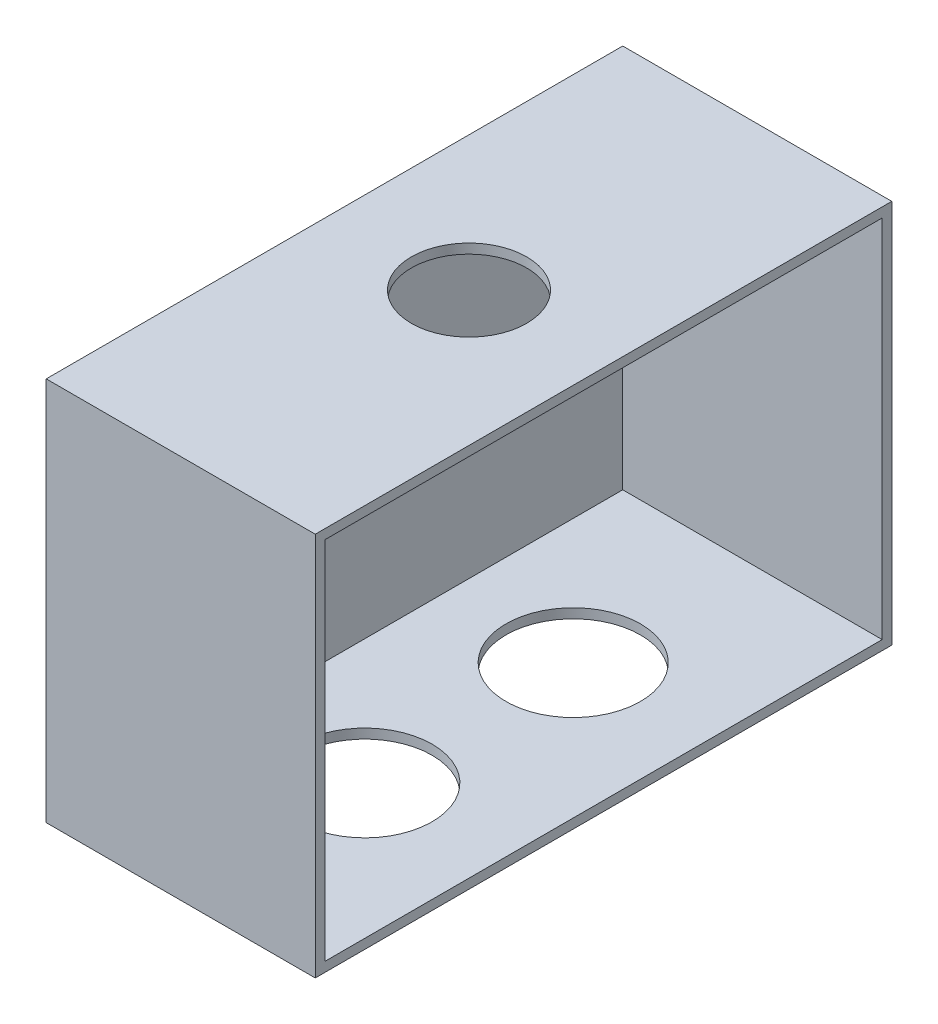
ISO-10303-21;
HEADER;
FILE_DESCRIPTION(('STEP AP214'),'2;1');
FILE_NAME('part.step','',(''),(''),'','','');
FILE_SCHEMA(('AUTOMOTIVE_DESIGN { 1 0 10303 214 1 1 1 1 }'));
ENDSEC;
DATA;
#1=APPLICATION_CONTEXT('core data for automotive mechanical design processes');
#2=APPLICATION_PROTOCOL_DEFINITION('international standard','automotive_design',2000,#1);
#3=PRODUCT_CONTEXT('',#1,'mechanical');
#4=PRODUCT('Part','Part','',(#3));
#5=PRODUCT_RELATED_PRODUCT_CATEGORY('part','',(#4));
#6=PRODUCT_DEFINITION_FORMATION('','',#4);
#7=PRODUCT_DEFINITION_CONTEXT('part definition',#1,'design');
#8=PRODUCT_DEFINITION('design','',#6,#7);
#9=PRODUCT_DEFINITION_SHAPE('','',#8);
#10=(LENGTH_UNIT() NAMED_UNIT(*) SI_UNIT(.MILLI.,.METRE.));
#11=(NAMED_UNIT(*) PLANE_ANGLE_UNIT() SI_UNIT($,.RADIAN.));
#12=(NAMED_UNIT(*) SI_UNIT($,.STERADIAN.) SOLID_ANGLE_UNIT());
#13=UNCERTAINTY_MEASURE_WITH_UNIT(LENGTH_MEASURE(1.E-05),#10,'distance_accuracy_value','');
#14=(GEOMETRIC_REPRESENTATION_CONTEXT(3) GLOBAL_UNCERTAINTY_ASSIGNED_CONTEXT((#13)) GLOBAL_UNIT_ASSIGNED_CONTEXT((#10,
#11,#12)) REPRESENTATION_CONTEXT('',''));
#15=CARTESIAN_POINT('',(0.,0.,0.));
#16=DIRECTION('',(0.,0.,1.));
#17=DIRECTION('',(1.,0.,0.));
#18=AXIS2_PLACEMENT_3D('',#15,#16,#17);
#19=CARTESIAN_POINT('',(35.,-50.,75.));
#20=DIRECTION('',(0.,1.,0.));
#21=DIRECTION('',(0.,0.,1.));
#22=AXIS2_PLACEMENT_3D('',#19,#20,#21);
#23=PLANE('',#22);
#24=CARTESIAN_POINT('',(0.,-50.,-27.1082489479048));
#25=DIRECTION('',(0.,1.,0.));
#26=DIRECTION('',(0.,0.,1.));
#27=AXIS2_PLACEMENT_3D('',#24,#25,#26);
#28=CIRCLE('',#27,17.5);
#29=CARTESIAN_POINT('',(0.,-50.,-9.6082489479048));
#30=VERTEX_POINT('',#29);
#31=EDGE_CURVE('E189',#30,#30,#28,.T.);
#32=ORIENTED_EDGE('',*,*,#31,.T.);
#33=EDGE_LOOP('',(#32));
#34=FACE_BOUND('',#33,.T.);
#35=DIRECTION('',(0.,0.,-1.));
#36=VECTOR('',#35,1.);
#37=CARTESIAN_POINT('',(-35.,-50.,75.));
#38=LINE('',#37,#36);
#39=CARTESIAN_POINT('',(-35.,-50.,75.));
#40=VERTEX_POINT('',#39);
#41=CARTESIAN_POINT('',(-35.,-50.,-75.));
#42=VERTEX_POINT('',#41);
#43=EDGE_CURVE('E80',#40,#42,#38,.T.);
#44=ORIENTED_EDGE('',*,*,#43,.T.);
#45=DIRECTION('',(-1.,0.,0.));
#46=VECTOR('',#45,1.);
#47=CARTESIAN_POINT('',(35.,-50.,-75.));
#48=LINE('',#47,#46);
#49=CARTESIAN_POINT('',(35.,-50.,-75.));
#50=VERTEX_POINT('',#49);
#51=EDGE_CURVE('E155',#50,#42,#48,.T.);
#52=ORIENTED_EDGE('',*,*,#51,.F.);
#53=DIRECTION('',(0.,0.,-1.));
#54=VECTOR('',#53,1.);
#55=CARTESIAN_POINT('',(35.,-50.,75.));
#56=LINE('',#55,#54);
#57=CARTESIAN_POINT('',(35.,-50.,75.));
#58=VERTEX_POINT('',#57);
#59=EDGE_CURVE('E59',#58,#50,#56,.T.);
#60=ORIENTED_EDGE('',*,*,#59,.F.);
#61=DIRECTION('',(-1.,0.,0.));
#62=VECTOR('',#61,1.);
#63=CARTESIAN_POINT('',(35.,-50.,75.));
#64=LINE('',#63,#62);
#65=EDGE_CURVE('E164',#58,#40,#64,.T.);
#66=ORIENTED_EDGE('',*,*,#65,.T.);
#67=EDGE_LOOP('',(#44,#52,#60,#66));
#68=FACE_BOUND('',#67,.T.);
#69=CARTESIAN_POINT('',(0.,-50.,27.1082489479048));
#70=DIRECTION('',(0.,1.,0.));
#71=DIRECTION('',(0.,0.,1.));
#72=AXIS2_PLACEMENT_3D('',#69,#70,#71);
#73=CIRCLE('',#72,17.5);
#74=CARTESIAN_POINT('',(0.,-50.,44.6082489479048));
#75=VERTEX_POINT('',#74);
#76=EDGE_CURVE('E184',#75,#75,#73,.T.);
#77=ORIENTED_EDGE('',*,*,#76,.T.);
#78=EDGE_LOOP('',(#77));
#79=FACE_BOUND('',#78,.T.);
#80=ADVANCED_FACE('F35',(#34,#68,#79),#23,.F.);
#81=CARTESIAN_POINT('',(-208.349358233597,-47.5,0.));
#82=DIRECTION('',(0.,-1.,0.));
#83=DIRECTION('',(0.,0.,-1.));
#84=AXIS2_PLACEMENT_3D('',#81,#82,#83);
#85=PLANE('',#84);
#86=CARTESIAN_POINT('',(0.,-47.5,-27.1082489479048));
#87=DIRECTION('',(0.,-1.,0.));
#88=DIRECTION('',(0.,0.,-1.));
#89=AXIS2_PLACEMENT_3D('',#86,#87,#88);
#90=CIRCLE('',#89,17.5);
#91=CARTESIAN_POINT('',(0.,-47.5,-44.6082489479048));
#92=VERTEX_POINT('',#91);
#93=EDGE_CURVE('E192',#92,#92,#90,.T.);
#94=ORIENTED_EDGE('',*,*,#93,.T.);
#95=EDGE_LOOP('',(#94));
#96=FACE_BOUND('',#95,.T.);
#97=DIRECTION('',(1.,0.,0.));
#98=VECTOR('',#97,1.);
#99=CARTESIAN_POINT('',(-208.349358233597,-47.5,72.5));
#100=LINE('',#99,#98);
#101=CARTESIAN_POINT('',(-32.5,-47.5,72.5));
#102=VERTEX_POINT('',#101);
#103=CARTESIAN_POINT('',(35.,-47.5,72.5));
#104=VERTEX_POINT('',#103);
#105=EDGE_CURVE('E142',#102,#104,#100,.T.);
#106=ORIENTED_EDGE('',*,*,#105,.T.);
#107=DIRECTION('',(0.,0.,-1.));
#108=VECTOR('',#107,1.);
#109=CARTESIAN_POINT('',(35.,-47.5,0.));
#110=LINE('',#109,#108);
#111=CARTESIAN_POINT('',(35.,-47.5,-72.5));
#112=VERTEX_POINT('',#111);
#113=EDGE_CURVE('E138',#104,#112,#110,.T.);
#114=ORIENTED_EDGE('',*,*,#113,.T.);
#115=DIRECTION('',(1.,0.,0.));
#116=VECTOR('',#115,1.);
#117=CARTESIAN_POINT('',(-208.349358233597,-47.5,-72.5));
#118=LINE('',#117,#116);
#119=CARTESIAN_POINT('',(-32.5,-47.5,-72.5));
#120=VERTEX_POINT('',#119);
#121=EDGE_CURVE('E141',#120,#112,#118,.T.);
#122=ORIENTED_EDGE('',*,*,#121,.F.);
#123=DIRECTION('',(0.,0.,-1.));
#124=VECTOR('',#123,1.);
#125=CARTESIAN_POINT('',(-32.5,-47.5,0.));
#126=LINE('',#125,#124);
#127=EDGE_CURVE('E131',#102,#120,#126,.T.);
#128=ORIENTED_EDGE('',*,*,#127,.F.);
#129=EDGE_LOOP('',(#106,#114,#122,#128));
#130=FACE_BOUND('',#129,.T.);
#131=CARTESIAN_POINT('',(0.,-47.5,27.1082489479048));
#132=DIRECTION('',(0.,-1.,0.));
#133=DIRECTION('',(0.,0.,-1.));
#134=AXIS2_PLACEMENT_3D('',#131,#132,#133);
#135=CIRCLE('',#134,17.5);
#136=CARTESIAN_POINT('',(0.,-47.5,9.6082489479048));
#137=VERTEX_POINT('',#136);
#138=EDGE_CURVE('E186',#137,#137,#135,.T.);
#139=ORIENTED_EDGE('',*,*,#138,.T.);
#140=EDGE_LOOP('',(#139));
#141=FACE_BOUND('',#140,.T.);
#142=ADVANCED_FACE('F179',(#96,#130,#141),#85,.F.);
#143=CARTESIAN_POINT('',(35.,50.,75.));
#144=DIRECTION('',(0.,-1.,0.));
#145=DIRECTION('',(0.,0.,-1.));
#146=AXIS2_PLACEMENT_3D('',#143,#144,#145);
#147=PLANE('',#146);
#148=DIRECTION('',(0.,0.,1.));
#149=VECTOR('',#148,1.);
#150=CARTESIAN_POINT('',(-35.,50.,75.));
#151=LINE('',#150,#149);
#152=CARTESIAN_POINT('',(-35.,50.,-75.));
#153=VERTEX_POINT('',#152);
#154=CARTESIAN_POINT('',(-35.,50.,75.));
#155=VERTEX_POINT('',#154);
#156=EDGE_CURVE('E158',#153,#155,#151,.T.);
#157=ORIENTED_EDGE('',*,*,#156,.T.);
#158=DIRECTION('',(-1.,0.,0.));
#159=VECTOR('',#158,1.);
#160=CARTESIAN_POINT('',(35.,50.,75.));
#161=LINE('',#160,#159);
#162=CARTESIAN_POINT('',(35.,50.,75.));
#163=VERTEX_POINT('',#162);
#164=EDGE_CURVE('E43',#163,#155,#161,.T.);
#165=ORIENTED_EDGE('',*,*,#164,.F.);
#166=DIRECTION('',(0.,0.,1.));
#167=VECTOR('',#166,1.);
#168=CARTESIAN_POINT('',(35.,50.,75.));
#169=LINE('',#168,#167);
#170=CARTESIAN_POINT('',(35.,50.,-75.));
#171=VERTEX_POINT('',#170);
#172=EDGE_CURVE('E87',#171,#163,#169,.T.);
#173=ORIENTED_EDGE('',*,*,#172,.F.);
#174=DIRECTION('',(-1.,0.,0.));
#175=VECTOR('',#174,1.);
#176=CARTESIAN_POINT('',(35.,50.,-75.));
#177=LINE('',#176,#175);
#178=EDGE_CURVE('E12',#171,#153,#177,.T.);
#179=ORIENTED_EDGE('',*,*,#178,.T.);
#180=EDGE_LOOP('',(#157,#165,#173,#179));
#181=FACE_BOUND('',#180,.T.);
#182=CARTESIAN_POINT('',(0.,50.,0.));
#183=DIRECTION('',(0.,-1.,0.));
#184=DIRECTION('',(0.,0.,-1.));
#185=AXIS2_PLACEMENT_3D('',#182,#183,#184);
#186=CIRCLE('',#185,15.);
#187=CARTESIAN_POINT('',(0.,50.,-15.));
#188=VERTEX_POINT('',#187);
#189=EDGE_CURVE('E195',#188,#188,#186,.T.);
#190=ORIENTED_EDGE('',*,*,#189,.T.);
#191=EDGE_LOOP('',(#190));
#192=FACE_BOUND('',#191,.T.);
#193=ADVANCED_FACE('F219',(#181,#192),#147,.F.);
#194=CARTESIAN_POINT('',(-208.349358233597,47.5,0.));
#195=DIRECTION('',(0.,1.,0.));
#196=DIRECTION('',(0.,0.,1.));
#197=AXIS2_PLACEMENT_3D('',#194,#195,#196);
#198=PLANE('',#197);
#199=DIRECTION('',(1.,0.,0.));
#200=VECTOR('',#199,1.);
#201=CARTESIAN_POINT('',(-208.349358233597,47.5,-72.5));
#202=LINE('',#201,#200);
#203=CARTESIAN_POINT('',(-32.5,47.5,-72.5));
#204=VERTEX_POINT('',#203);
#205=CARTESIAN_POINT('',(35.,47.5,-72.5));
#206=VERTEX_POINT('',#205);
#207=EDGE_CURVE('E115',#204,#206,#202,.T.);
#208=ORIENTED_EDGE('',*,*,#207,.T.);
#209=DIRECTION('',(0.,0.,1.));
#210=VECTOR('',#209,1.);
#211=CARTESIAN_POINT('',(35.,47.5,0.));
#212=LINE('',#211,#210);
#213=CARTESIAN_POINT('',(35.,47.5,72.5));
#214=VERTEX_POINT('',#213);
#215=EDGE_CURVE('E134',#206,#214,#212,.T.);
#216=ORIENTED_EDGE('',*,*,#215,.T.);
#217=DIRECTION('',(1.,0.,0.));
#218=VECTOR('',#217,1.);
#219=CARTESIAN_POINT('',(-208.349358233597,47.5,72.5));
#220=LINE('',#219,#218);
#221=CARTESIAN_POINT('',(-32.5,47.5,72.5));
#222=VERTEX_POINT('',#221);
#223=EDGE_CURVE('E117',#222,#214,#220,.T.);
#224=ORIENTED_EDGE('',*,*,#223,.F.);
#225=DIRECTION('',(0.,0.,1.));
#226=VECTOR('',#225,1.);
#227=CARTESIAN_POINT('',(-32.5,47.5,0.));
#228=LINE('',#227,#226);
#229=EDGE_CURVE('E110',#204,#222,#228,.T.);
#230=ORIENTED_EDGE('',*,*,#229,.F.);
#231=EDGE_LOOP('',(#208,#216,#224,#230));
#232=FACE_BOUND('',#231,.T.);
#233=CARTESIAN_POINT('',(0.,47.5,0.));
#234=DIRECTION('',(0.,1.,0.));
#235=DIRECTION('',(0.,0.,1.));
#236=AXIS2_PLACEMENT_3D('',#233,#234,#235);
#237=CIRCLE('',#236,15.);
#238=CARTESIAN_POINT('',(0.,47.5,15.));
#239=VERTEX_POINT('',#238);
#240=EDGE_CURVE('E198',#239,#239,#237,.T.);
#241=ORIENTED_EDGE('',*,*,#240,.T.);
#242=EDGE_LOOP('',(#241));
#243=FACE_BOUND('',#242,.T.);
#244=ADVANCED_FACE('F112',(#232,#243),#198,.F.);
#245=CARTESIAN_POINT('',(35.,-50.,-75.));
#246=DIRECTION('',(0.,0.,1.));
#247=DIRECTION('',(1.,0.,0.));
#248=AXIS2_PLACEMENT_3D('',#245,#246,#247);
#249=PLANE('',#248);
#250=DIRECTION('',(0.,1.,0.));
#251=VECTOR('',#250,1.);
#252=CARTESIAN_POINT('',(-35.,-50.,-75.));
#253=LINE('',#252,#251);
#254=EDGE_CURVE('E148',#42,#153,#253,.T.);
#255=ORIENTED_EDGE('',*,*,#254,.T.);
#256=ORIENTED_EDGE('',*,*,#178,.F.);
#257=DIRECTION('',(0.,1.,0.));
#258=VECTOR('',#257,1.);
#259=CARTESIAN_POINT('',(35.,-50.,-75.));
#260=LINE('',#259,#258);
#261=EDGE_CURVE('E149',#50,#171,#260,.T.);
#262=ORIENTED_EDGE('',*,*,#261,.F.);
#263=ORIENTED_EDGE('',*,*,#51,.T.);
#264=EDGE_LOOP('',(#255,#256,#262,#263));
#265=FACE_BOUND('',#264,.T.);
#266=ADVANCED_FACE('F37',(#265),#249,.F.);
#267=CARTESIAN_POINT('',(35.,-50.,75.));
#268=DIRECTION('',(0.,0.,-1.));
#269=DIRECTION('',(-1.,0.,0.));
#270=AXIS2_PLACEMENT_3D('',#267,#268,#269);
#271=PLANE('',#270);
#272=DIRECTION('',(0.,-1.,0.));
#273=VECTOR('',#272,1.);
#274=CARTESIAN_POINT('',(-35.,-50.,75.));
#275=LINE('',#274,#273);
#276=EDGE_CURVE('E160',#155,#40,#275,.T.);
#277=ORIENTED_EDGE('',*,*,#276,.T.);
#278=ORIENTED_EDGE('',*,*,#65,.F.);
#279=DIRECTION('',(0.,-1.,0.));
#280=VECTOR('',#279,1.);
#281=CARTESIAN_POINT('',(35.,-50.,75.));
#282=LINE('',#281,#280);
#283=EDGE_CURVE('E152',#163,#58,#282,.T.);
#284=ORIENTED_EDGE('',*,*,#283,.F.);
#285=ORIENTED_EDGE('',*,*,#164,.T.);
#286=EDGE_LOOP('',(#277,#278,#284,#285));
#287=FACE_BOUND('',#286,.T.);
#288=ADVANCED_FACE('F169',(#287),#271,.F.);
#289=CARTESIAN_POINT('',(35.,0.,0.));
#290=DIRECTION('',(-1.,0.,0.));
#291=DIRECTION('',(0.,0.,1.));
#292=AXIS2_PLACEMENT_3D('',#289,#290,#291);
#293=PLANE('',#292);
#294=ORIENTED_EDGE('',*,*,#215,.F.);
#295=DIRECTION('',(0.,1.,0.));
#296=VECTOR('',#295,1.);
#297=CARTESIAN_POINT('',(35.,0.,-72.5));
#298=LINE('',#297,#296);
#299=EDGE_CURVE('E127',#112,#206,#298,.T.);
#300=ORIENTED_EDGE('',*,*,#299,.F.);
#301=ORIENTED_EDGE('',*,*,#113,.F.);
#302=DIRECTION('',(0.,-1.,0.));
#303=VECTOR('',#302,1.);
#304=CARTESIAN_POINT('',(35.,0.,72.5));
#305=LINE('',#304,#303);
#306=EDGE_CURVE('E50',#214,#104,#305,.T.);
#307=ORIENTED_EDGE('',*,*,#306,.F.);
#308=EDGE_LOOP('',(#294,#300,#301,#307));
#309=FACE_BOUND('',#308,.T.);
#310=ORIENTED_EDGE('',*,*,#261,.T.);
#311=ORIENTED_EDGE('',*,*,#172,.T.);
#312=ORIENTED_EDGE('',*,*,#283,.T.);
#313=ORIENTED_EDGE('',*,*,#59,.T.);
#314=EDGE_LOOP('',(#310,#311,#312,#313));
#315=FACE_BOUND('',#314,.T.);
#316=ADVANCED_FACE('F208',(#309,#315),#293,.F.);
#317=CARTESIAN_POINT('',(-35.,0.,0.));
#318=DIRECTION('',(-1.,0.,0.));
#319=DIRECTION('',(0.,0.,1.));
#320=AXIS2_PLACEMENT_3D('',#317,#318,#319);
#321=PLANE('',#320);
#322=ORIENTED_EDGE('',*,*,#254,.F.);
#323=ORIENTED_EDGE('',*,*,#43,.F.);
#324=ORIENTED_EDGE('',*,*,#276,.F.);
#325=ORIENTED_EDGE('',*,*,#156,.F.);
#326=EDGE_LOOP('',(#322,#323,#324,#325));
#327=FACE_BOUND('',#326,.T.);
#328=ADVANCED_FACE('F173',(#327),#321,.T.);
#329=CARTESIAN_POINT('',(-32.5,0.,0.));
#330=DIRECTION('',(-1.,0.,0.));
#331=DIRECTION('',(0.,0.,1.));
#332=AXIS2_PLACEMENT_3D('',#329,#330,#331);
#333=PLANE('',#332);
#334=ORIENTED_EDGE('',*,*,#127,.T.);
#335=DIRECTION('',(0.,1.,0.));
#336=VECTOR('',#335,1.);
#337=CARTESIAN_POINT('',(-32.5,0.,-72.5));
#338=LINE('',#337,#336);
#339=EDGE_CURVE('E124',#120,#204,#338,.T.);
#340=ORIENTED_EDGE('',*,*,#339,.T.);
#341=ORIENTED_EDGE('',*,*,#229,.T.);
#342=DIRECTION('',(0.,-1.,0.));
#343=VECTOR('',#342,1.);
#344=CARTESIAN_POINT('',(-32.5,0.,72.5));
#345=LINE('',#344,#343);
#346=EDGE_CURVE('E143',#222,#102,#345,.T.);
#347=ORIENTED_EDGE('',*,*,#346,.T.);
#348=EDGE_LOOP('',(#334,#340,#341,#347));
#349=FACE_BOUND('',#348,.T.);
#350=ADVANCED_FACE('F130',(#349),#333,.F.);
#351=CARTESIAN_POINT('',(-208.349358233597,0.,-72.5));
#352=DIRECTION('',(0.,0.,-1.));
#353=DIRECTION('',(-1.,0.,0.));
#354=AXIS2_PLACEMENT_3D('',#351,#352,#353);
#355=PLANE('',#354);
#356=ORIENTED_EDGE('',*,*,#121,.T.);
#357=ORIENTED_EDGE('',*,*,#299,.T.);
#358=ORIENTED_EDGE('',*,*,#207,.F.);
#359=ORIENTED_EDGE('',*,*,#339,.F.);
#360=EDGE_LOOP('',(#356,#357,#358,#359));
#361=FACE_BOUND('',#360,.T.);
#362=ADVANCED_FACE('F123',(#361),#355,.F.);
#363=CARTESIAN_POINT('',(-208.349358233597,0.,72.5));
#364=DIRECTION('',(0.,0.,1.));
#365=DIRECTION('',(1.,0.,0.));
#366=AXIS2_PLACEMENT_3D('',#363,#364,#365);
#367=PLANE('',#366);
#368=ORIENTED_EDGE('',*,*,#223,.T.);
#369=ORIENTED_EDGE('',*,*,#306,.T.);
#370=ORIENTED_EDGE('',*,*,#105,.F.);
#371=ORIENTED_EDGE('',*,*,#346,.F.);
#372=EDGE_LOOP('',(#368,#369,#370,#371));
#373=FACE_BOUND('',#372,.T.);
#374=ADVANCED_FACE('F235',(#373),#367,.F.);
#375=CARTESIAN_POINT('',(0.,-50.001,0.));
#376=DIRECTION('',(0.,1.,0.));
#377=DIRECTION('',(0.,0.,1.));
#378=AXIS2_PLACEMENT_3D('',#375,#376,#377);
#379=CYLINDRICAL_SURFACE('',#378,15.);
#380=ORIENTED_EDGE('',*,*,#189,.F.);
#381=EDGE_LOOP('',(#380));
#382=FACE_BOUND('',#381,.T.);
#383=ORIENTED_EDGE('',*,*,#240,.F.);
#384=EDGE_LOOP('',(#383));
#385=FACE_BOUND('',#384,.T.);
#386=ADVANCED_FACE('F231',(#382,#385),#379,.F.);
#387=CARTESIAN_POINT('',(0.,50.001,-27.1082489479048));
#388=DIRECTION('',(0.,-1.,0.));
#389=DIRECTION('',(0.,0.,-1.));
#390=AXIS2_PLACEMENT_3D('',#387,#388,#389);
#391=CYLINDRICAL_SURFACE('',#390,17.5);
#392=ORIENTED_EDGE('',*,*,#31,.F.);
#393=EDGE_LOOP('',(#392));
#394=FACE_BOUND('',#393,.T.);
#395=ORIENTED_EDGE('',*,*,#93,.F.);
#396=EDGE_LOOP('',(#395));
#397=FACE_BOUND('',#396,.T.);
#398=ADVANCED_FACE('F234',(#394,#397),#391,.F.);
#399=CARTESIAN_POINT('',(0.,50.001,27.1082489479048));
#400=DIRECTION('',(0.,-1.,0.));
#401=DIRECTION('',(0.,0.,-1.));
#402=AXIS2_PLACEMENT_3D('',#399,#400,#401);
#403=CYLINDRICAL_SURFACE('',#402,17.5);
#404=ORIENTED_EDGE('',*,*,#76,.F.);
#405=EDGE_LOOP('',(#404));
#406=FACE_BOUND('',#405,.T.);
#407=ORIENTED_EDGE('',*,*,#138,.F.);
#408=EDGE_LOOP('',(#407));
#409=FACE_BOUND('',#408,.T.);
#410=ADVANCED_FACE('F242',(#406,#409),#403,.F.);
#411=CLOSED_SHELL('',(#80,#142,#193,#244,#266,#288,#316,#328,#350,#362,#374,#386,#398,#410));
#412=MANIFOLD_SOLID_BREP('B2',#411);
#413=ADVANCED_BREP_SHAPE_REPRESENTATION('',(#18,#412),#14);
#414=SHAPE_DEFINITION_REPRESENTATION(#9,#413);
ENDSEC;
END-ISO-10303-21;
